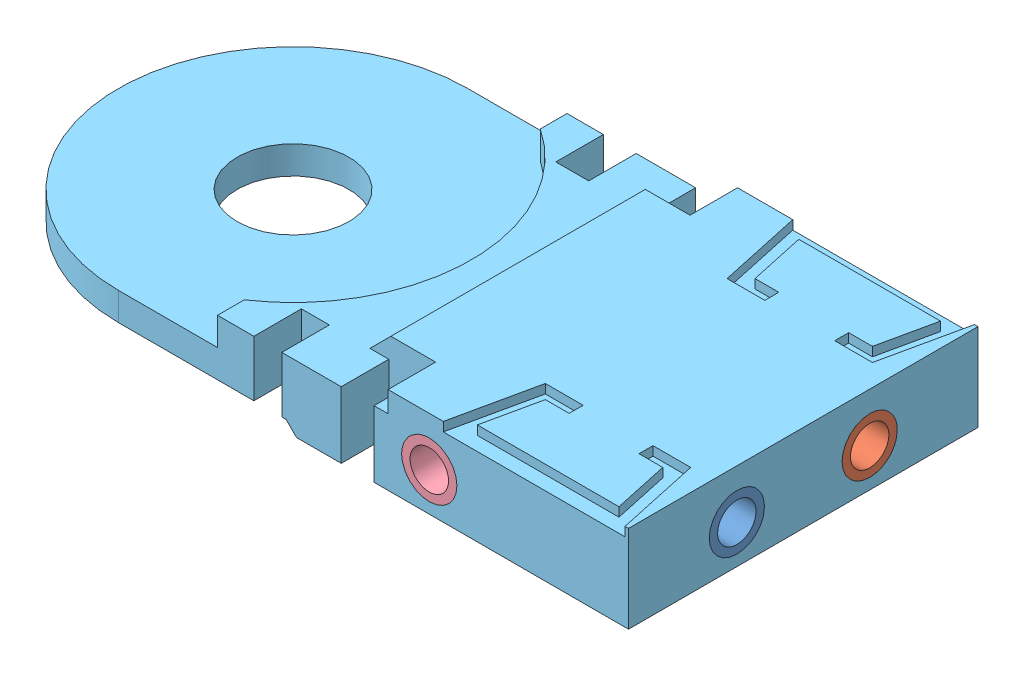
SolidWorks assembly 2024_10_24_12_30_43_0207.sldasm, configuration Standard (file format 10000). Lengths in mm.
Overall size (98 12.5 50).
5 component instances, 5 part files, 0 mates.
Components (placement in the parent):
- 2024_10_24_12_30_43_0411-1: 2024_10_24_12_30_43_0411.sldprt [Standard] at origin size (7 10 10)
- 2024_10_24_12_30_43_0395-1: 2024_10_24_12_30_43_0395.sldprt [Standard] at origin size (7 10 10)
- 2024_10_24_12_30_43_0379-1: 2024_10_24_12_30_43_0379.sldprt [Standard] at origin size (10 10 7)
- 2024_10_24_12_30_43_0364-1: 2024_10_24_12_30_43_0364.sldprt [Standard] at origin size (10 10 7)
- 2024_10_24_12_30_43_0348-1: 2024_10_24_12_30_43_0348.sldprt [Standard] at origin size (98 12.5 50)
